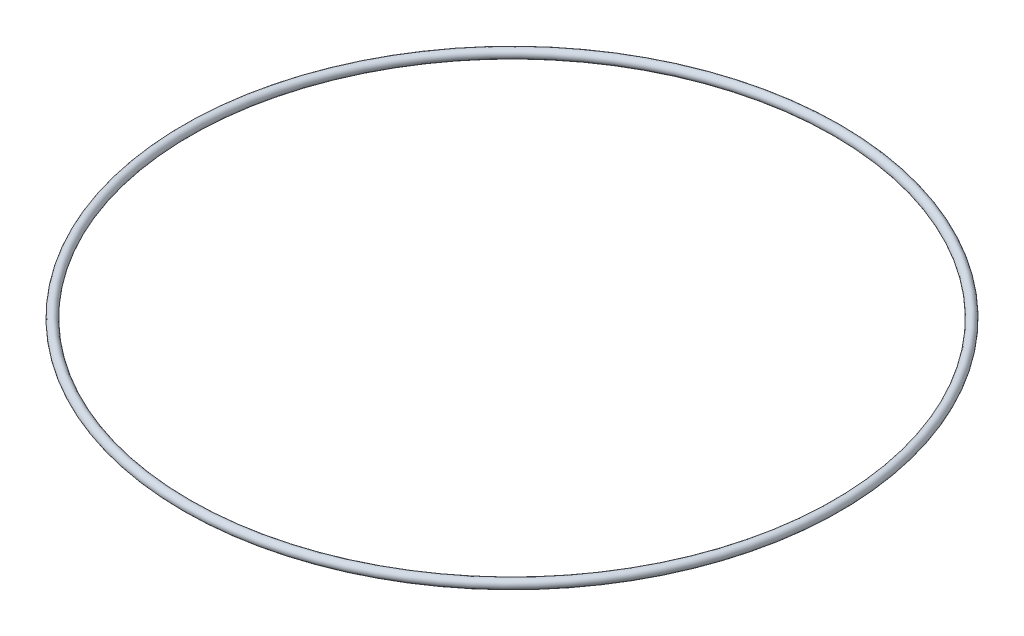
ISO-10303-21;
HEADER;
FILE_DESCRIPTION(('STEP AP214'),'2;1');
FILE_NAME('part.step','',(''),(''),'','','');
FILE_SCHEMA(('AUTOMOTIVE_DESIGN { 1 0 10303 214 1 1 1 1 }'));
ENDSEC;
DATA;
#1=APPLICATION_CONTEXT('core data for automotive mechanical design processes');
#2=APPLICATION_PROTOCOL_DEFINITION('international standard','automotive_design',2000,#1);
#3=PRODUCT_CONTEXT('',#1,'mechanical');
#4=PRODUCT('Part','Part','',(#3));
#5=PRODUCT_RELATED_PRODUCT_CATEGORY('part','',(#4));
#6=PRODUCT_DEFINITION_FORMATION('','',#4);
#7=PRODUCT_DEFINITION_CONTEXT('part definition',#1,'design');
#8=PRODUCT_DEFINITION('design','',#6,#7);
#9=PRODUCT_DEFINITION_SHAPE('','',#8);
#10=(LENGTH_UNIT() NAMED_UNIT(*) SI_UNIT(.MILLI.,.METRE.));
#11=(NAMED_UNIT(*) PLANE_ANGLE_UNIT() SI_UNIT($,.RADIAN.));
#12=(NAMED_UNIT(*) SI_UNIT($,.STERADIAN.) SOLID_ANGLE_UNIT());
#13=UNCERTAINTY_MEASURE_WITH_UNIT(LENGTH_MEASURE(1.E-05),#10,'distance_accuracy_value','');
#14=(GEOMETRIC_REPRESENTATION_CONTEXT(3) GLOBAL_UNCERTAINTY_ASSIGNED_CONTEXT((#13)) GLOBAL_UNIT_ASSIGNED_CONTEXT((#10,
#11,#12)) REPRESENTATION_CONTEXT('',''));
#15=CARTESIAN_POINT('',(0.,0.,0.));
#16=DIRECTION('',(0.,0.,1.));
#17=DIRECTION('',(1.,0.,0.));
#18=AXIS2_PLACEMENT_3D('',#15,#16,#17);
#19=CARTESIAN_POINT('',(0.,1.5,0.));
#20=DIRECTION('',(0.,1.,0.));
#21=DIRECTION('',(0.,0.,1.));
#22=AXIS2_PLACEMENT_3D('',#19,#20,#21);
#23=TOROIDAL_SURFACE('',#22,108.,1.5);
#24=CARTESIAN_POINT('',(0.,1.5,109.5));
#25=VERTEX_POINT('',#24);
#26=VERTEX_LOOP('',#25);
#27=FACE_BOUND('',#26,.T.);
#28=ADVANCED_FACE('F30',(#27),#23,.T.);
#29=CLOSED_SHELL('',(#28));
#30=MANIFOLD_SOLID_BREP('B2',#29);
#31=ADVANCED_BREP_SHAPE_REPRESENTATION('',(#18,#30),#14);
#32=SHAPE_DEFINITION_REPRESENTATION(#9,#31);
ENDSEC;
END-ISO-10303-21;
